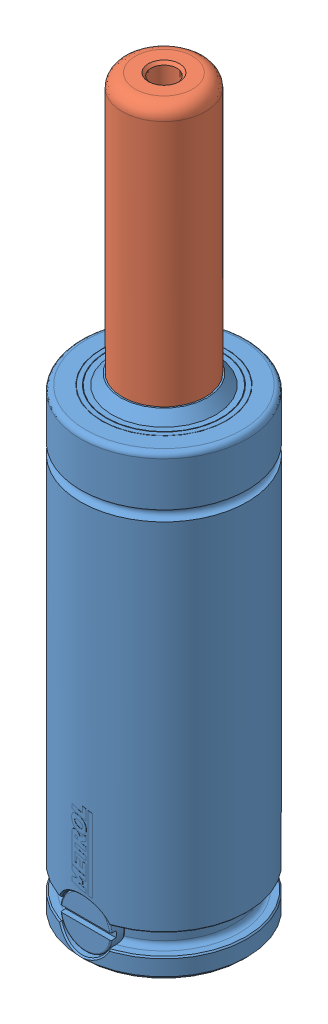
SolidWorks assembly EX360-050.SLDASM, configuration Default (file format 7000). Lengths in mm.
Overall size (32 140 32.1).
2 component instances, 2 part files, 6 mates.
Components (placement in the parent):
- EX0360 Body-1: EX0360 Body.SLDPRT [EX-360-050] x (0 0 1) z (0 -1 0) size (32.1 32 90)
- EX-360 Piston-1: EX-360 Piston.SLDPRT [EX-360-050] at (0 73 0) x (0 0 1) z (0 -1 0) size (24 24 67)
Mates (geometry in assembly coordinates):
- Concentric1: concentric aligned: cylinder of EX0360 Body-1 through (0 0 0) axis (0 -1 0) radius 8; cylinder of EX-360 Piston-1 through (0 73 0) axis (0 -1 0) radius 8
- LimitDistance1: limit distance anti-aligned: plane of EX0360 Body-1 through (0 78 0) normal (0 -1 0); plane of EX-360 Piston-1 through (-12 78 0) normal (0 1 0)
- Coincident3: coincident anti-aligned: plane of EX0360 Body-1 through (0 0 0) normal (0 -1 0); plane of assembly through (0 0 0) normal (0 1 0)
- Coincident4: coincident anti-aligned: plane of EX0360 Body-1; plane of assembly through (0 0 0) normal (1 0 0)
- Coincident5: coincident aligned: plane of EX0360 Body-1; plane of assembly through (0 0 0) normal (0 0 1)
- Perpendicular1: perpendicular: plane of EX-360 Piston-1; plane of assembly through (0 0 0) normal (0 0 1)
